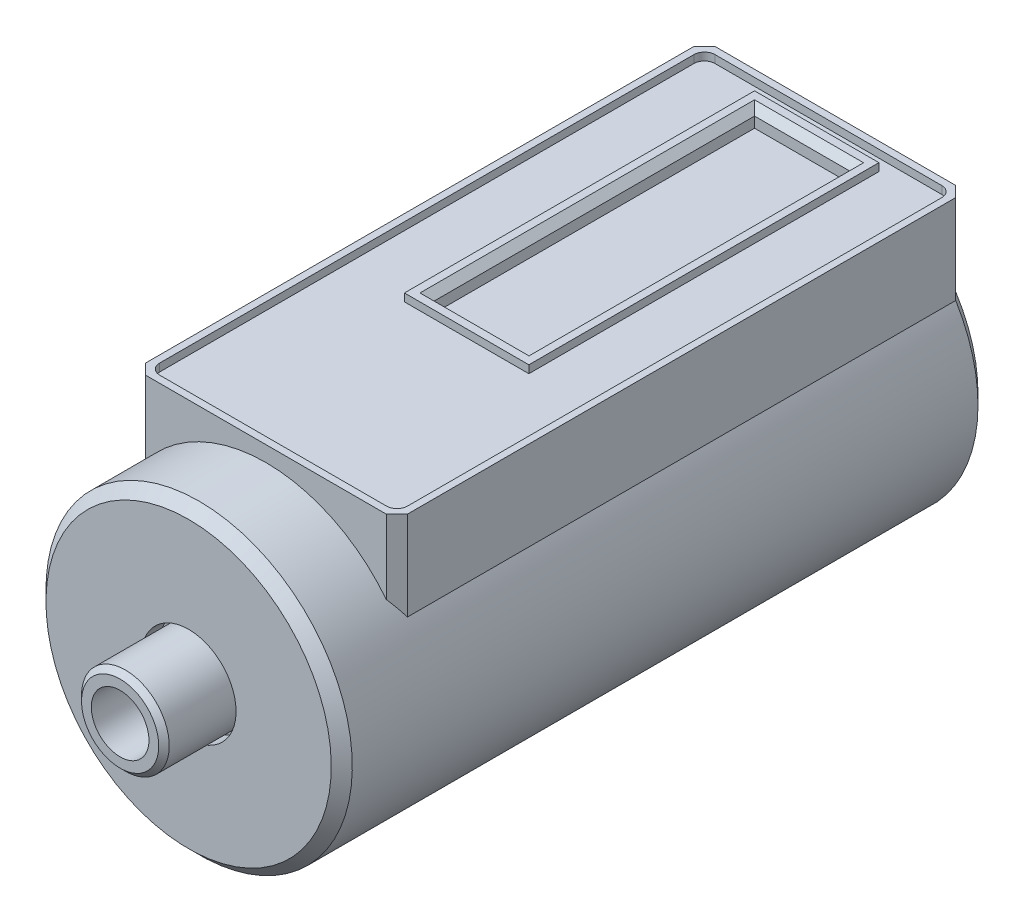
from build123d import *

# Parameters (mm, degrees)
EXTRUDE1_DEPTH     = 12.19
CHAMFER1_SIZE      = 0.76
SKETCH4_W          = 8.99
SKETCH4_H          = 25.3
CUT_EXTRUDE1_DEPTH = 0.56
SKETCH5_W          = 6.86
SKETCH5_H          = 23.16
CUT_EXTRUDE2_DEPTH = 1.27
CHAMFER2_SIZE      = 0.51
HOLE1_D            = 4.1656
HOLE1_DEPTH        = 6.35
HOLE1_TIP          = 1.251472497


with BuildPart() as part:
    # Sketch2 → Revolve1 (revolve)
    with BuildSketch(Plane(origin=(0, 0, 0), x_dir=(0, 0, -1), z_dir=(1, 0, 0))):
        Polygon((21.335, 0), (21.335, 2.79), (21.715, 3.17), (27.555, 3.17), (27.555, 3.43), (26.285, 3.43), (26.285, 10.31), (27.045, 11.07), (73.025, 11.07), (73.025, 0), align=None)
    revolve(axis=Axis((0, 0, -73.025), (0, 0, 1)))

    # Sketch3 → Extrude1 (add)
    with BuildSketch(Plane(origin=(0, 0, 0), x_dir=(1, 0, 0), z_dir=(0, 1, 0))):
        Polygon((-9.46, 73.025), (9.46, 73.025), (9.46, 32.635), (8.7, 31.875), (-8.7, 31.875), (-9.46, 32.635), align=None)
    extrude(amount=EXTRUDE1_DEPTH)

    # Chamfer1
    chamfer1_edges = [part.edges().sort_by_distance(p)[0] for p in [
        (0, -11.07, -73.025),
        (-9.46, 8.969599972, -73.025),
        (9.46, 8.969599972, -73.025),
    ]]
    chamfer(chamfer1_edges, length=CHAMFER1_SIZE)

    # Sketch4 → Cut-Extrude1 (cut)
    with BuildSketch(Plane(origin=(0, 12.19, 0), x_dir=(1, 0, 0), z_dir=(0, 1, 0))):
        with BuildLine():
            Line((-8.19, 72.515), (8.2, 72.515))
            ThreePointArc((8.2, 72.515), (8.737401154, 72.292401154), (8.96, 71.755))
            Line((8.96, 71.755), (8.96, 33.145))
            ThreePointArc((8.96, 33.145), (8.737401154, 32.607598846), (8.2, 32.385))
            Line((8.2, 32.385), (-8.19, 32.385))
            ThreePointArc((-8.19, 32.385), (-8.727401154, 32.607598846), (-8.95, 33.145))
            Line((-8.95, 33.145), (-8.95, 71.755))
            ThreePointArc((-8.95, 71.755), (-8.727401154, 72.292401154), (-8.19, 72.515))
        make_face()
        with Locations((0.005, 59.025)):
            Rectangle(SKETCH4_W, SKETCH4_H, mode=Mode.SUBTRACT)
    extrude(amount=-CUT_EXTRUDE1_DEPTH, mode=Mode.SUBTRACT)

    # Sketch5 → Cut-Extrude2 (cut)
    with BuildSketch(Plane(origin=(0, 12.19, 0), x_dir=(1, 0, 0), z_dir=(0, 1, 0))):
        with Locations((0.01, 59.025)):
            Rectangle(SKETCH5_W, SKETCH5_H)
    extrude(amount=-CUT_EXTRUDE2_DEPTH, mode=Mode.SUBTRACT)

    # Chamfer2
    chamfer2_edges = [part.edges().sort_by_distance(p)[0] for p in [
        (-3.42, 12.19, -59.025),
        (0.01, 12.19, -47.445),
        (3.44, 12.19, -59.025),
        (0.01, 12.19, -70.605),
    ]]
    chamfer(chamfer2_edges, length=CHAMFER2_SIZE)

    # Hole1
    with Locations(Plane.XY.offset(-21.335)):
        with Locations((0, 0)):
            Hole(HOLE1_D / 2, depth=HOLE1_DEPTH)
            with Locations((0, 0, -(HOLE1_DEPTH + HOLE1_TIP / 2))):  # 118° drill point
                Cone(0, HOLE1_D / 2, HOLE1_TIP, mode=Mode.SUBTRACT)


solid = part.part
